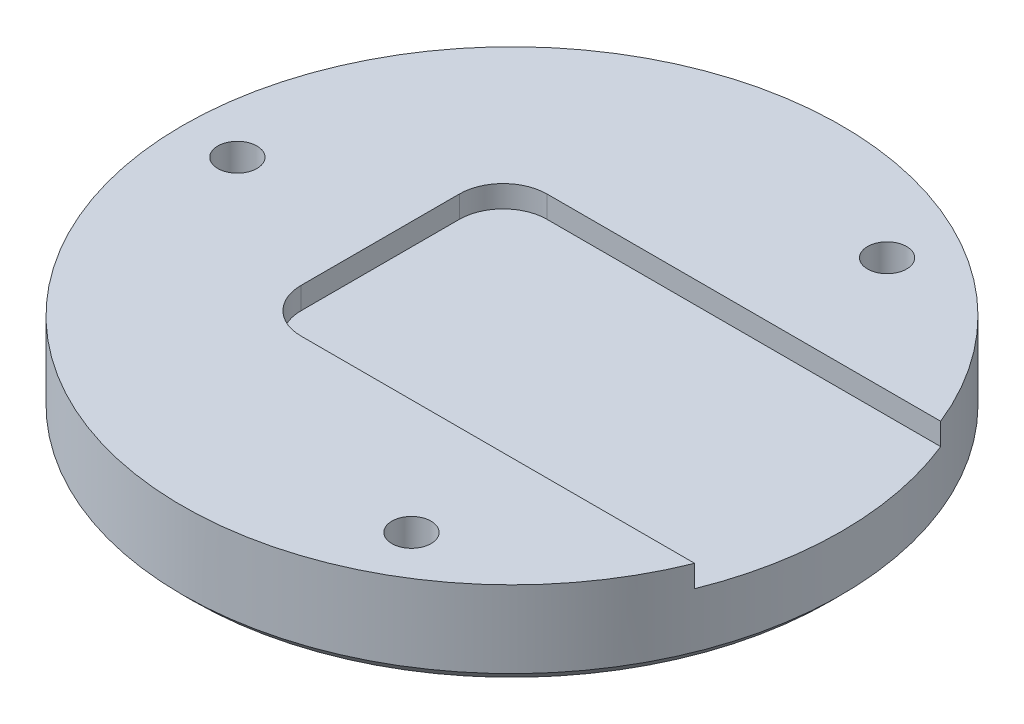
from build123d import *

# Parameters (mm, degrees)
BOSS_EXTRUDE1_START   = -10.16
SKETCH1_R             = 19.05
BOSS_EXTRUDE1_DEPTH   = 5.08
CUT_EXTRUDE1_START    = -80.505141
CUT_EXTRUDE1_DEPTH    = 1.27
F_4_40_TAPPED_HOLE1_D = 2.2606
CIRPATTERN1_COUNT     = 3
CHAMFER1_SIZE         = 0.635


with BuildPart() as part:
    # Sketch1 → Boss-Extrude1 (new body)
    with BuildSketch(Plane(origin=(48.175932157, -74.155140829, 64.167776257), x_dir=(0.9892657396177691, 0, -0.1461276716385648), z_dir=(0, 1, 0)).offset(BOSS_EXTRUDE1_START)):
        with Locations(Location((0, 0, 0), (0, 0, 261.597414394))):
            Circle(SKETCH1_R)
    extrude(amount=BOSS_EXTRUDE1_DEPTH)

    # Sketch2 → Cut-Extrude1 (cut)
    with BuildSketch(Plane(origin=(0, 0, 0), x_dir=(1, 0, 0), z_dir=(0, 1, 0)).offset(CUT_EXTRUDE1_START)):
        with BuildLine():
            Line((43.095932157, -57.055776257), (65.848565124, -57.055776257))
            ThreePointArc((65.848565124, -57.055776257), (67.225932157, -64.167776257), (65.848565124, -71.279776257))
            Line((65.848565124, -71.279776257), (43.095932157, -71.279776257))
            ThreePointArc((43.095932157, -71.279776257), (41.299880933, -70.535827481), (40.555932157, -68.739776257))
            Line((40.555932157, -68.739776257), (40.555932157, -59.595776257))
            ThreePointArc((40.555932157, -59.595776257), (41.299880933, -57.799725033), (43.095932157, -57.055776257))
        make_face()
    extrude(amount=CUT_EXTRUDE1_DEPTH, mode=Mode.SUBTRACT)

    # 4-40 Tapped Hole1 (through all)
    with Locations(Plane(origin=(0, -79.235140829, 0), x_dir=(1, 0, 0), z_dir=(0, 1, 0))):
        with Locations((32.300932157, -64.167776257)):
            f_4_40_tapped_hole1 = Hole(F_4_40_TAPPED_HOLE1_D / 2)

    # CirPattern1: 4-40 Tapped Hole1 ×3 about axis
    cirpattern1_axis = Axis((48.175932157, 0, 64.167776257), (0, 1, 0))
    for i in range(1, CIRPATTERN1_COUNT):
        add(f_4_40_tapped_hole1.rotate(cirpattern1_axis, i * 360 / CIRPATTERN1_COUNT), mode=Mode.SUBTRACT)

    # Chamfer1
    chamfer1_edges = [part.edges().sort_by_distance(p)[0] for p in [
        (48.175932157, -84.315140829, 45.117776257),
    ]]
    chamfer(chamfer1_edges, length=CHAMFER1_SIZE)


solid = part.part
